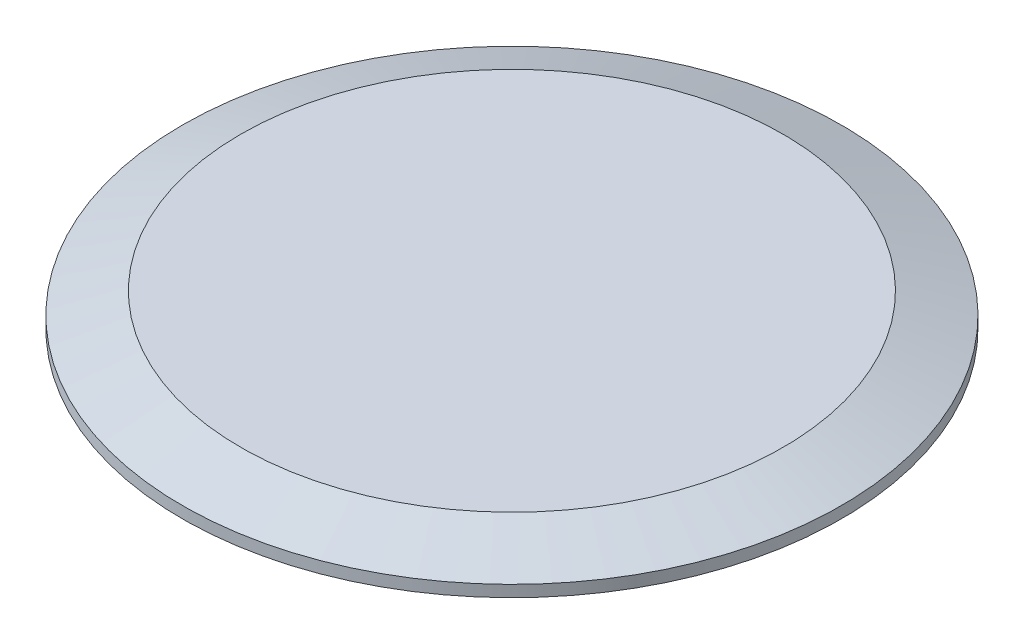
ISO-10303-21;
HEADER;
FILE_DESCRIPTION(('STEP AP214'),'2;1');
FILE_NAME('part.step','',(''),(''),'','','');
FILE_SCHEMA(('AUTOMOTIVE_DESIGN { 1 0 10303 214 1 1 1 1 }'));
ENDSEC;
DATA;
#1=APPLICATION_CONTEXT('core data for automotive mechanical design processes');
#2=APPLICATION_PROTOCOL_DEFINITION('international standard','automotive_design',2000,#1);
#3=PRODUCT_CONTEXT('',#1,'mechanical');
#4=PRODUCT('Part','Part','',(#3));
#5=PRODUCT_RELATED_PRODUCT_CATEGORY('part','',(#4));
#6=PRODUCT_DEFINITION_FORMATION('','',#4);
#7=PRODUCT_DEFINITION_CONTEXT('part definition',#1,'design');
#8=PRODUCT_DEFINITION('design','',#6,#7);
#9=PRODUCT_DEFINITION_SHAPE('','',#8);
#10=(LENGTH_UNIT() NAMED_UNIT(*) SI_UNIT(.MILLI.,.METRE.));
#11=(NAMED_UNIT(*) PLANE_ANGLE_UNIT() SI_UNIT($,.RADIAN.));
#12=(NAMED_UNIT(*) SI_UNIT($,.STERADIAN.) SOLID_ANGLE_UNIT());
#13=UNCERTAINTY_MEASURE_WITH_UNIT(LENGTH_MEASURE(1.E-05),#10,'distance_accuracy_value','');
#14=(GEOMETRIC_REPRESENTATION_CONTEXT(3) GLOBAL_UNCERTAINTY_ASSIGNED_CONTEXT((#13)) GLOBAL_UNIT_ASSIGNED_CONTEXT((#10,
#11,#12)) REPRESENTATION_CONTEXT('',''));
#15=CARTESIAN_POINT('',(0.,0.,0.));
#16=DIRECTION('',(0.,0.,1.));
#17=DIRECTION('',(1.,0.,0.));
#18=AXIS2_PLACEMENT_3D('',#15,#16,#17);
#19=CARTESIAN_POINT('',(-131.37569978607,15.875,0.));
#20=DIRECTION('',(0.,1.,0.));
#21=DIRECTION('',(-1.,0.,0.));
#22=AXIS2_PLACEMENT_3D('',#19,#20,#21);
#23=PLANE('',#22);
#24=CARTESIAN_POINT('',(0.,15.875,0.));
#25=DIRECTION('',(0.,1.,0.));
#26=DIRECTION('',(-1.,0.,0.));
#27=AXIS2_PLACEMENT_3D('',#24,#25,#26);
#28=CIRCLE('',#27,131.37569978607);
#29=CARTESIAN_POINT('',(-131.37569978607,15.875,0.));
#30=VERTEX_POINT('',#29);
#31=EDGE_CURVE('E10',#30,#30,#28,.T.);
#32=ORIENTED_EDGE('',*,*,#31,.T.);
#33=EDGE_LOOP('',(#32));
#34=FACE_BOUND('',#33,.T.);
#35=ADVANCED_FACE('F31',(#34),#23,.T.);
#36=CARTESIAN_POINT('',(0.,15.875,0.));
#37=DIRECTION('',(0.,-1.,0.));
#38=DIRECTION('',(1.,0.,0.));
#39=AXIS2_PLACEMENT_3D('',#36,#37,#38);
#40=CONICAL_SURFACE('',#39,131.37569978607,1.22173047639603);
#41=CARTESIAN_POINT('',(0.,5.588,0.));
#42=DIRECTION('',(0.,1.,0.));
#43=DIRECTION('',(-1.,0.,0.));
#44=AXIS2_PLACEMENT_3D('',#41,#42,#43);
#45=CIRCLE('',#44,159.639);
#46=CARTESIAN_POINT('',(-159.639,5.58799999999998,0.));
#47=VERTEX_POINT('',#46);
#48=EDGE_CURVE('E37',#47,#47,#45,.T.);
#49=ORIENTED_EDGE('',*,*,#48,.T.);
#50=EDGE_LOOP('',(#49));
#51=FACE_BOUND('',#50,.T.);
#52=ORIENTED_EDGE('',*,*,#31,.F.);
#53=EDGE_LOOP('',(#52));
#54=FACE_BOUND('',#53,.T.);
#55=ADVANCED_FACE('F72',(#51,#54),#40,.T.);
#56=CARTESIAN_POINT('',(0.,15.875,0.));
#57=DIRECTION('',(0.,1.,0.));
#58=DIRECTION('',(-1.,0.,0.));
#59=AXIS2_PLACEMENT_3D('',#56,#57,#58);
#60=CYLINDRICAL_SURFACE('',#59,159.639);
#61=CARTESIAN_POINT('',(0.,0.,0.));
#62=DIRECTION('',(0.,1.,0.));
#63=DIRECTION('',(-1.,0.,0.));
#64=AXIS2_PLACEMENT_3D('',#61,#62,#63);
#65=CIRCLE('',#64,159.639);
#66=CARTESIAN_POINT('',(-159.639,0.,0.));
#67=VERTEX_POINT('',#66);
#68=EDGE_CURVE('E41',#67,#67,#65,.T.);
#69=ORIENTED_EDGE('',*,*,#68,.T.);
#70=EDGE_LOOP('',(#69));
#71=FACE_BOUND('',#70,.T.);
#72=ORIENTED_EDGE('',*,*,#48,.F.);
#73=EDGE_LOOP('',(#72));
#74=FACE_BOUND('',#73,.T.);
#75=ADVANCED_FACE('F76',(#71,#74),#60,.T.);
#76=CARTESIAN_POINT('',(-156.199208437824,0.,0.));
#77=DIRECTION('',(0.,-1.,0.));
#78=DIRECTION('',(1.,0.,0.));
#79=AXIS2_PLACEMENT_3D('',#76,#77,#78);
#80=PLANE('',#79);
#81=CARTESIAN_POINT('',(0.,0.,0.));
#82=DIRECTION('',(0.,1.,0.));
#83=DIRECTION('',(-1.,0.,0.));
#84=AXIS2_PLACEMENT_3D('',#81,#82,#83);
#85=CIRCLE('',#84,156.199208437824);
#86=CARTESIAN_POINT('',(-156.199208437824,0.,0.));
#87=VERTEX_POINT('',#86);
#88=EDGE_CURVE('E45',#87,#87,#85,.T.);
#89=ORIENTED_EDGE('',*,*,#88,.T.);
#90=EDGE_LOOP('',(#89));
#91=FACE_BOUND('',#90,.T.);
#92=ORIENTED_EDGE('',*,*,#68,.F.);
#93=EDGE_LOOP('',(#92));
#94=FACE_BOUND('',#93,.T.);
#95=ADVANCED_FACE('F80',(#91,#94),#80,.T.);
#96=CARTESIAN_POINT('',(0.,0.787400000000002,0.));
#97=DIRECTION('',(0.,1.,0.));
#98=DIRECTION('',(-1.,0.,0.));
#99=AXIS2_PLACEMENT_3D('',#96,#97,#98);
#100=TOROIDAL_SURFACE('',#99,156.199208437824,0.78739999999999);
#101=CARTESIAN_POINT('',(0.,0.474458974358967,0.));
#102=DIRECTION('',(0.,1.,0.));
#103=DIRECTION('',(-1.,0.,0.));
#104=AXIS2_PLACEMENT_3D('',#101,#102,#103);
#105=CIRCLE('',#104,155.476666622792);
#106=CARTESIAN_POINT('',(-155.476666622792,0.474458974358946,0.));
#107=VERTEX_POINT('',#106);
#108=EDGE_CURVE('E50',#107,#107,#105,.T.);
#109=ORIENTED_EDGE('',*,*,#108,.T.);
#110=EDGE_LOOP('',(#109));
#111=FACE_BOUND('',#110,.T.);
#112=ORIENTED_EDGE('',*,*,#88,.F.);
#113=EDGE_LOOP('',(#112));
#114=FACE_BOUND('',#113,.T.);
#115=ADVANCED_FACE('F87',(#111,#114),#100,.T.);
#116=CARTESIAN_POINT('',(0.,0.,0.));
#117=DIRECTION('',(0.,1.,0.));
#118=DIRECTION('',(-1.,0.,0.));
#119=AXIS2_PLACEMENT_3D('',#116,#117,#118);
#120=TOROIDAL_SURFACE('',#119,154.3812,1.19380000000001);
#121=CARTESIAN_POINT('',(0.,0.474458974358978,0.));
#122=DIRECTION('',(0.,1.,0.));
#123=DIRECTION('',(-1.,0.,0.));
#124=AXIS2_PLACEMENT_3D('',#121,#122,#123);
#125=CIRCLE('',#124,153.285733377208);
#126=CARTESIAN_POINT('',(-153.285733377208,0.474458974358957,0.));
#127=VERTEX_POINT('',#126);
#128=EDGE_CURVE('E53',#127,#127,#125,.T.);
#129=ORIENTED_EDGE('',*,*,#128,.T.);
#130=EDGE_LOOP('',(#129));
#131=FACE_BOUND('',#130,.T.);
#132=ORIENTED_EDGE('',*,*,#108,.F.);
#133=EDGE_LOOP('',(#132));
#134=FACE_BOUND('',#133,.T.);
#135=ADVANCED_FACE('F69',(#131,#134),#120,.F.);
#136=CARTESIAN_POINT('',(0.,0.787400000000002,0.));
#137=DIRECTION('',(0.,1.,0.));
#138=DIRECTION('',(-1.,0.,0.));
#139=AXIS2_PLACEMENT_3D('',#136,#137,#138);
#140=TOROIDAL_SURFACE('',#139,152.563191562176,0.787400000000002);
#141=CARTESIAN_POINT('',(0.,0.,0.));
#142=DIRECTION('',(0.,1.,0.));
#143=DIRECTION('',(-1.,0.,0.));
#144=AXIS2_PLACEMENT_3D('',#141,#142,#143);
#145=CIRCLE('',#144,152.563191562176);
#146=CARTESIAN_POINT('',(-152.563191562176,0.,0.));
#147=VERTEX_POINT('',#146);
#148=EDGE_CURVE('E56',#147,#147,#145,.T.);
#149=ORIENTED_EDGE('',*,*,#148,.T.);
#150=EDGE_LOOP('',(#149));
#151=FACE_BOUND('',#150,.T.);
#152=ORIENTED_EDGE('',*,*,#128,.F.);
#153=EDGE_LOOP('',(#152));
#154=FACE_BOUND('',#153,.T.);
#155=ADVANCED_FACE('F60',(#151,#154),#140,.T.);
#156=CARTESIAN_POINT('',(0.,0.,0.));
#157=DIRECTION('',(0.,-1.,0.));
#158=DIRECTION('',(1.,0.,0.));
#159=AXIS2_PLACEMENT_3D('',#156,#157,#158);
#160=PLANE('',#159);
#161=ORIENTED_EDGE('',*,*,#148,.F.);
#162=EDGE_LOOP('',(#161));
#163=FACE_BOUND('',#162,.T.);
#164=ADVANCED_FACE('F63',(#163),#160,.T.);
#165=CLOSED_SHELL('',(#35,#55,#75,#95,#115,#135,#155,#164));
#166=MANIFOLD_SOLID_BREP('B2',#165);
#167=ADVANCED_BREP_SHAPE_REPRESENTATION('',(#18,#166),#14);
#168=SHAPE_DEFINITION_REPRESENTATION(#9,#167);
ENDSEC;
END-ISO-10303-21;
